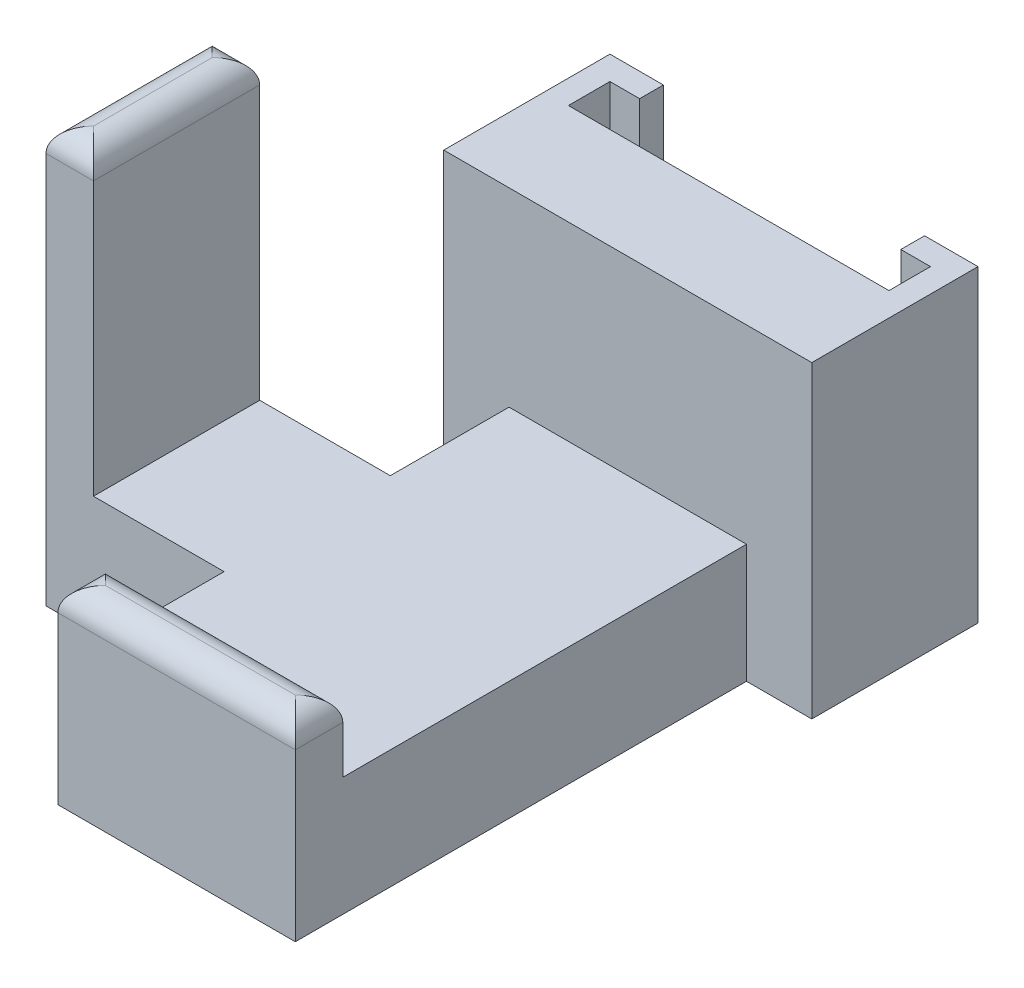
ISO-10303-21;
HEADER;
FILE_DESCRIPTION(('STEP AP214'),'2;1');
FILE_NAME('part.step','',(''),(''),'','','');
FILE_SCHEMA(('AUTOMOTIVE_DESIGN { 1 0 10303 214 1 1 1 1 }'));
ENDSEC;
DATA;
#1=APPLICATION_CONTEXT('core data for automotive mechanical design processes');
#2=APPLICATION_PROTOCOL_DEFINITION('international standard','automotive_design',2000,#1);
#3=PRODUCT_CONTEXT('',#1,'mechanical');
#4=PRODUCT('Part','Part','',(#3));
#5=PRODUCT_RELATED_PRODUCT_CATEGORY('part','',(#4));
#6=PRODUCT_DEFINITION_FORMATION('','',#4);
#7=PRODUCT_DEFINITION_CONTEXT('part definition',#1,'design');
#8=PRODUCT_DEFINITION('design','',#6,#7);
#9=PRODUCT_DEFINITION_SHAPE('','',#8);
#10=(LENGTH_UNIT() NAMED_UNIT(*) SI_UNIT(.MILLI.,.METRE.));
#11=(NAMED_UNIT(*) PLANE_ANGLE_UNIT() SI_UNIT($,.RADIAN.));
#12=(NAMED_UNIT(*) SI_UNIT($,.STERADIAN.) SOLID_ANGLE_UNIT());
#13=UNCERTAINTY_MEASURE_WITH_UNIT(LENGTH_MEASURE(1.E-05),#10,'distance_accuracy_value','');
#14=(GEOMETRIC_REPRESENTATION_CONTEXT(3) GLOBAL_UNCERTAINTY_ASSIGNED_CONTEXT((#13)) GLOBAL_UNIT_ASSIGNED_CONTEXT((#10,
#11,#12)) REPRESENTATION_CONTEXT('',''));
#15=CARTESIAN_POINT('',(0.,0.,0.));
#16=DIRECTION('',(0.,0.,1.));
#17=DIRECTION('',(1.,0.,0.));
#18=AXIS2_PLACEMENT_3D('',#15,#16,#17);
#19=CARTESIAN_POINT('',(0.,10.,0.));
#20=DIRECTION('',(0.,1.,0.));
#21=DIRECTION('',(0.,0.,1.));
#22=AXIS2_PLACEMENT_3D('',#19,#20,#21);
#23=PLANE('',#22);
#24=DIRECTION('',(0.,0.,-1.));
#25=VECTOR('',#24,1.);
#26=CARTESIAN_POINT('',(20.,10.,0.));
#27=LINE('',#26,#25);
#28=CARTESIAN_POINT('',(20.,10.,-3.99999999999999));
#29=VERTEX_POINT('',#28);
#30=CARTESIAN_POINT('',(20.,10.,-38.));
#31=VERTEX_POINT('',#30);
#32=EDGE_CURVE('E386',#29,#31,#27,.T.);
#33=ORIENTED_EDGE('',*,*,#32,.T.);
#34=DIRECTION('',(1.,0.,0.));
#35=VECTOR('',#34,1.);
#36=CARTESIAN_POINT('',(20.,10.,-38.));
#37=LINE('',#36,#35);
#38=CARTESIAN_POINT('',(0.,10.,-38.));
#39=VERTEX_POINT('',#38);
#40=EDGE_CURVE('E267',#39,#31,#37,.T.);
#41=ORIENTED_EDGE('',*,*,#40,.F.);
#42=DIRECTION('',(0.,0.,1.));
#43=VECTOR('',#42,1.);
#44=CARTESIAN_POINT('',(0.,10.,-28.));
#45=LINE('',#44,#43);
#46=CARTESIAN_POINT('',(0.,10.,-28.));
#47=VERTEX_POINT('',#46);
#48=EDGE_CURVE('E391',#39,#47,#45,.T.);
#49=ORIENTED_EDGE('',*,*,#48,.T.);
#50=DIRECTION('',(-1.,0.,0.));
#51=VECTOR('',#50,1.);
#52=CARTESIAN_POINT('',(0.,10.,-28.));
#53=LINE('',#52,#51);
#54=CARTESIAN_POINT('',(-11.,10.,-28.));
#55=VERTEX_POINT('',#54);
#56=EDGE_CURVE('E394',#47,#55,#53,.T.);
#57=ORIENTED_EDGE('',*,*,#56,.T.);
#58=DIRECTION('',(0.,0.,-1.));
#59=VECTOR('',#58,1.);
#60=CARTESIAN_POINT('',(-11.,10.,-28.));
#61=LINE('',#60,#59);
#62=CARTESIAN_POINT('',(-11.,10.,-14.));
#63=VERTEX_POINT('',#62);
#64=EDGE_CURVE('E371',#63,#55,#61,.T.);
#65=ORIENTED_EDGE('',*,*,#64,.F.);
#66=DIRECTION('',(1.,0.,0.));
#67=VECTOR('',#66,1.);
#68=CARTESIAN_POINT('',(0.,10.,-14.));
#69=LINE('',#68,#67);
#70=CARTESIAN_POINT('',(0.,10.,-14.));
#71=VERTEX_POINT('',#70);
#72=EDGE_CURVE('E398',#63,#71,#69,.T.);
#73=ORIENTED_EDGE('',*,*,#72,.T.);
#74=DIRECTION('',(0.,0.,1.));
#75=VECTOR('',#74,1.);
#76=CARTESIAN_POINT('',(0.,10.,0.));
#77=LINE('',#76,#75);
#78=CARTESIAN_POINT('',(0.,10.,-4.));
#79=VERTEX_POINT('',#78);
#80=EDGE_CURVE('E382',#71,#79,#77,.T.);
#81=ORIENTED_EDGE('',*,*,#80,.T.);
#82=DIRECTION('',(-1.,0.,0.));
#83=VECTOR('',#82,1.);
#84=CARTESIAN_POINT('',(0.,10.,-4.));
#85=LINE('',#84,#83);
#86=EDGE_CURVE('E360',#29,#79,#85,.T.);
#87=ORIENTED_EDGE('',*,*,#86,.F.);
#88=EDGE_LOOP('',(#33,#41,#49,#57,#65,#73,#81,#87));
#89=FACE_BOUND('',#88,.T.);
#90=ADVANCED_FACE('F42',(#89),#23,.T.);
#91=CARTESIAN_POINT('',(20.,10.,0.));
#92=DIRECTION('',(-1.,0.,0.));
#93=DIRECTION('',(0.,0.,1.));
#94=AXIS2_PLACEMENT_3D('',#91,#92,#93);
#95=PLANE('',#94);
#96=DIRECTION('',(0.,-1.,0.));
#97=VECTOR('',#96,1.);
#98=CARTESIAN_POINT('',(20.,10.,-38.));
#99=LINE('',#98,#97);
#100=CARTESIAN_POINT('',(20.,0.,-38.));
#101=VERTEX_POINT('',#100);
#102=EDGE_CURVE('E355',#31,#101,#99,.T.);
#103=ORIENTED_EDGE('',*,*,#102,.F.);
#104=ORIENTED_EDGE('',*,*,#32,.F.);
#105=DIRECTION('',(0.,-1.,0.));
#106=VECTOR('',#105,1.);
#107=CARTESIAN_POINT('',(20.,35.,-4.));
#108=LINE('',#107,#106);
#109=CARTESIAN_POINT('',(20.,14.,-4.));
#110=VERTEX_POINT('',#109);
#111=EDGE_CURVE('E368',#110,#29,#108,.T.);
#112=ORIENTED_EDGE('',*,*,#111,.F.);
#113=DIRECTION('',(0.,0.,1.));
#114=VECTOR('',#113,1.);
#115=CARTESIAN_POINT('',(20.,14.,0.));
#116=LINE('',#115,#114);
#117=CARTESIAN_POINT('',(20.,14.,0.));
#118=VERTEX_POINT('',#117);
#119=EDGE_CURVE('E457',#110,#118,#116,.T.);
#120=ORIENTED_EDGE('',*,*,#119,.T.);
#121=DIRECTION('',(0.,-1.,0.));
#122=VECTOR('',#121,1.);
#123=CARTESIAN_POINT('',(20.,10.,0.));
#124=LINE('',#123,#122);
#125=CARTESIAN_POINT('',(20.,0.,0.));
#126=VERTEX_POINT('',#125);
#127=EDGE_CURVE('E438',#118,#126,#124,.T.);
#128=ORIENTED_EDGE('',*,*,#127,.T.);
#129=DIRECTION('',(0.,0.,-1.));
#130=VECTOR('',#129,1.);
#131=CARTESIAN_POINT('',(20.,0.,0.));
#132=LINE('',#131,#130);
#133=EDGE_CURVE('E409',#126,#101,#132,.T.);
#134=ORIENTED_EDGE('',*,*,#133,.T.);
#135=EDGE_LOOP('',(#103,#104,#112,#120,#128,#134));
#136=FACE_BOUND('',#135,.T.);
#137=ADVANCED_FACE('F515',(#136),#95,.F.);
#138=CARTESIAN_POINT('',(0.,10.,-28.));
#139=DIRECTION('',(1.,0.,0.));
#140=DIRECTION('',(0.,0.,-1.));
#141=AXIS2_PLACEMENT_3D('',#138,#139,#140);
#142=PLANE('',#141);
#143=ORIENTED_EDGE('',*,*,#48,.F.);
#144=DIRECTION('',(0.,1.,0.));
#145=VECTOR('',#144,1.);
#146=CARTESIAN_POINT('',(0.,10.,-38.));
#147=LINE('',#146,#145);
#148=CARTESIAN_POINT('',(0.,0.,-38.));
#149=VERTEX_POINT('',#148);
#150=EDGE_CURVE('E349',#149,#39,#147,.T.);
#151=ORIENTED_EDGE('',*,*,#150,.F.);
#152=DIRECTION('',(0.,0.,1.));
#153=VECTOR('',#152,1.);
#154=CARTESIAN_POINT('',(0.,0.,-28.));
#155=LINE('',#154,#153);
#156=CARTESIAN_POINT('',(0.,0.,-28.));
#157=VERTEX_POINT('',#156);
#158=EDGE_CURVE('E412',#149,#157,#155,.T.);
#159=ORIENTED_EDGE('',*,*,#158,.T.);
#160=DIRECTION('',(0.,-1.,0.));
#161=VECTOR('',#160,1.);
#162=CARTESIAN_POINT('',(0.,10.,-28.));
#163=LINE('',#162,#161);
#164=EDGE_CURVE('E434',#47,#157,#163,.T.);
#165=ORIENTED_EDGE('',*,*,#164,.F.);
#166=EDGE_LOOP('',(#143,#151,#159,#165));
#167=FACE_BOUND('',#166,.T.);
#168=ADVANCED_FACE('F565',(#167),#142,.F.);
#169=CARTESIAN_POINT('',(0.,10.,0.));
#170=DIRECTION('',(1.,0.,0.));
#171=DIRECTION('',(0.,0.,-1.));
#172=AXIS2_PLACEMENT_3D('',#169,#170,#171);
#173=PLANE('',#172);
#174=DIRECTION('',(0.,-1.,0.));
#175=VECTOR('',#174,1.);
#176=CARTESIAN_POINT('',(0.,10.,0.));
#177=LINE('',#176,#175);
#178=CARTESIAN_POINT('',(0.,14.,0.));
#179=VERTEX_POINT('',#178);
#180=CARTESIAN_POINT('',(0.,0.,0.));
#181=VERTEX_POINT('',#180);
#182=EDGE_CURVE('E441',#179,#181,#177,.T.);
#183=ORIENTED_EDGE('',*,*,#182,.F.);
#184=DIRECTION('',(0.,0.,-1.));
#185=VECTOR('',#184,1.);
#186=CARTESIAN_POINT('',(0.,14.,-4.));
#187=LINE('',#186,#185);
#188=CARTESIAN_POINT('',(0.,14.,-4.));
#189=VERTEX_POINT('',#188);
#190=EDGE_CURVE('E52',#179,#189,#187,.T.);
#191=ORIENTED_EDGE('',*,*,#190,.T.);
#192=DIRECTION('',(0.,-1.,0.));
#193=VECTOR('',#192,1.);
#194=CARTESIAN_POINT('',(0.,35.,-4.));
#195=LINE('',#194,#193);
#196=EDGE_CURVE('E364',#189,#79,#195,.T.);
#197=ORIENTED_EDGE('',*,*,#196,.T.);
#198=ORIENTED_EDGE('',*,*,#80,.F.);
#199=DIRECTION('',(0.,-1.,0.));
#200=VECTOR('',#199,1.);
#201=CARTESIAN_POINT('',(0.,10.,-14.));
#202=LINE('',#201,#200);
#203=CARTESIAN_POINT('',(0.,0.,-14.));
#204=VERTEX_POINT('',#203);
#205=EDGE_CURVE('E401',#71,#204,#202,.T.);
#206=ORIENTED_EDGE('',*,*,#205,.T.);
#207=DIRECTION('',(0.,0.,1.));
#208=VECTOR('',#207,1.);
#209=CARTESIAN_POINT('',(0.,0.,0.));
#210=LINE('',#209,#208);
#211=EDGE_CURVE('E381',#204,#181,#210,.T.);
#212=ORIENTED_EDGE('',*,*,#211,.T.);
#213=EDGE_LOOP('',(#183,#191,#197,#198,#206,#212));
#214=FACE_BOUND('',#213,.T.);
#215=ADVANCED_FACE('F588',(#214),#173,.F.);
#216=CARTESIAN_POINT('',(0.,10.,0.));
#217=DIRECTION('',(0.,0.,-1.));
#218=DIRECTION('',(-1.,0.,0.));
#219=AXIS2_PLACEMENT_3D('',#216,#217,#218);
#220=PLANE('',#219);
#221=ORIENTED_EDGE('',*,*,#127,.F.);
#222=DIRECTION('',(-1.,0.,0.));
#223=VECTOR('',#222,1.);
#224=CARTESIAN_POINT('',(0.,14.,0.));
#225=LINE('',#224,#223);
#226=EDGE_CURVE('E461',#118,#179,#225,.T.);
#227=ORIENTED_EDGE('',*,*,#226,.T.);
#228=ORIENTED_EDGE('',*,*,#182,.T.);
#229=DIRECTION('',(1.,0.,0.));
#230=VECTOR('',#229,1.);
#231=CARTESIAN_POINT('',(0.,0.,0.));
#232=LINE('',#231,#230);
#233=EDGE_CURVE('E405',#181,#126,#232,.T.);
#234=ORIENTED_EDGE('',*,*,#233,.T.);
#235=EDGE_LOOP('',(#221,#227,#228,#234));
#236=FACE_BOUND('',#235,.T.);
#237=ADVANCED_FACE('F518',(#236),#220,.F.);
#238=CARTESIAN_POINT('',(0.,35.,-4.));
#239=DIRECTION('',(0.,0.,1.));
#240=DIRECTION('',(1.,0.,0.));
#241=AXIS2_PLACEMENT_3D('',#238,#239,#240);
#242=PLANE('',#241);
#243=ORIENTED_EDGE('',*,*,#196,.F.);
#244=DIRECTION('',(-1.,0.,0.));
#245=VECTOR('',#244,1.);
#246=CARTESIAN_POINT('',(20.,14.,-4.));
#247=LINE('',#246,#245);
#248=EDGE_CURVE('E13',#189,#110,#247,.F.);
#249=ORIENTED_EDGE('',*,*,#248,.T.);
#250=ORIENTED_EDGE('',*,*,#111,.T.);
#251=ORIENTED_EDGE('',*,*,#86,.T.);
#252=EDGE_LOOP('',(#243,#249,#250,#251));
#253=FACE_BOUND('',#252,.T.);
#254=ADVANCED_FACE('F585',(#253),#242,.F.);
#255=CARTESIAN_POINT('',(0.,10.,-28.));
#256=DIRECTION('',(0.,0.,1.));
#257=DIRECTION('',(1.,0.,0.));
#258=AXIS2_PLACEMENT_3D('',#255,#256,#257);
#259=PLANE('',#258);
#260=DIRECTION('',(0.,-1.,0.));
#261=VECTOR('',#260,1.);
#262=CARTESIAN_POINT('',(-15.,10.,-28.));
#263=LINE('',#262,#261);
#264=CARTESIAN_POINT('',(-15.,33.,-28.));
#265=VERTEX_POINT('',#264);
#266=CARTESIAN_POINT('',(-15.,0.,-28.));
#267=VERTEX_POINT('',#266);
#268=EDGE_CURVE('E431',#265,#267,#263,.T.);
#269=ORIENTED_EDGE('',*,*,#268,.F.);
#270=DIRECTION('',(-1.,0.,0.));
#271=VECTOR('',#270,1.);
#272=CARTESIAN_POINT('',(-11.,33.,-28.));
#273=LINE('',#272,#271);
#274=CARTESIAN_POINT('',(-11.,33.,-28.));
#275=VERTEX_POINT('',#274);
#276=EDGE_CURVE('E444',#265,#275,#273,.F.);
#277=ORIENTED_EDGE('',*,*,#276,.T.);
#278=DIRECTION('',(0.,-1.,0.));
#279=VECTOR('',#278,1.);
#280=CARTESIAN_POINT('',(-11.,35.,-28.));
#281=LINE('',#280,#279);
#282=EDGE_CURVE('E375',#275,#55,#281,.T.);
#283=ORIENTED_EDGE('',*,*,#282,.T.);
#284=ORIENTED_EDGE('',*,*,#56,.F.);
#285=ORIENTED_EDGE('',*,*,#164,.T.);
#286=DIRECTION('',(-1.,0.,0.));
#287=VECTOR('',#286,1.);
#288=CARTESIAN_POINT('',(0.,0.,-28.));
#289=LINE('',#288,#287);
#290=EDGE_CURVE('E415',#157,#267,#289,.T.);
#291=ORIENTED_EDGE('',*,*,#290,.T.);
#292=EDGE_LOOP('',(#269,#277,#283,#284,#285,#291));
#293=FACE_BOUND('',#292,.T.);
#294=ADVANCED_FACE('F581',(#293),#259,.F.);
#295=CARTESIAN_POINT('',(-15.,10.,-14.));
#296=DIRECTION('',(1.,0.,0.));
#297=DIRECTION('',(0.,0.,-1.));
#298=AXIS2_PLACEMENT_3D('',#295,#296,#297);
#299=PLANE('',#298);
#300=DIRECTION('',(0.,-1.,0.));
#301=VECTOR('',#300,1.);
#302=CARTESIAN_POINT('',(-15.,10.,-14.));
#303=LINE('',#302,#301);
#304=CARTESIAN_POINT('',(-15.,33.,-14.));
#305=VERTEX_POINT('',#304);
#306=CARTESIAN_POINT('',(-15.,0.,-14.));
#307=VERTEX_POINT('',#306);
#308=EDGE_CURVE('E428',#305,#307,#303,.T.);
#309=ORIENTED_EDGE('',*,*,#308,.F.);
#310=DIRECTION('',(0.,0.,1.));
#311=VECTOR('',#310,1.);
#312=CARTESIAN_POINT('',(-15.,33.,-28.));
#313=LINE('',#312,#311);
#314=EDGE_CURVE('E454',#305,#265,#313,.F.);
#315=ORIENTED_EDGE('',*,*,#314,.T.);
#316=ORIENTED_EDGE('',*,*,#268,.T.);
#317=DIRECTION('',(0.,0.,1.));
#318=VECTOR('',#317,1.);
#319=CARTESIAN_POINT('',(-15.,0.,-14.));
#320=LINE('',#319,#318);
#321=EDGE_CURVE('E419',#267,#307,#320,.T.);
#322=ORIENTED_EDGE('',*,*,#321,.T.);
#323=EDGE_LOOP('',(#309,#315,#316,#322));
#324=FACE_BOUND('',#323,.T.);
#325=ADVANCED_FACE('F577',(#324),#299,.F.);
#326=CARTESIAN_POINT('',(0.,10.,-14.));
#327=DIRECTION('',(0.,0.,-1.));
#328=DIRECTION('',(-1.,0.,0.));
#329=AXIS2_PLACEMENT_3D('',#326,#327,#328);
#330=PLANE('',#329);
#331=DIRECTION('',(0.,-1.,0.));
#332=VECTOR('',#331,1.);
#333=CARTESIAN_POINT('',(-11.,35.,-14.));
#334=LINE('',#333,#332);
#335=CARTESIAN_POINT('',(-11.,33.,-14.));
#336=VERTEX_POINT('',#335);
#337=EDGE_CURVE('E378',#336,#63,#334,.T.);
#338=ORIENTED_EDGE('',*,*,#337,.F.);
#339=DIRECTION('',(1.,0.,0.));
#340=VECTOR('',#339,1.);
#341=CARTESIAN_POINT('',(-15.,33.,-14.));
#342=LINE('',#341,#340);
#343=EDGE_CURVE('E451',#336,#305,#342,.F.);
#344=ORIENTED_EDGE('',*,*,#343,.T.);
#345=ORIENTED_EDGE('',*,*,#308,.T.);
#346=DIRECTION('',(1.,0.,0.));
#347=VECTOR('',#346,1.);
#348=CARTESIAN_POINT('',(0.,0.,-14.));
#349=LINE('',#348,#347);
#350=EDGE_CURVE('E387',#307,#204,#349,.T.);
#351=ORIENTED_EDGE('',*,*,#350,.T.);
#352=ORIENTED_EDGE('',*,*,#205,.F.);
#353=ORIENTED_EDGE('',*,*,#72,.F.);
#354=EDGE_LOOP('',(#338,#344,#345,#351,#352,#353));
#355=FACE_BOUND('',#354,.T.);
#356=ADVANCED_FACE('F573',(#355),#330,.F.);
#357=CARTESIAN_POINT('',(0.,0.,0.));
#358=DIRECTION('',(0.,1.,0.));
#359=DIRECTION('',(0.,0.,1.));
#360=AXIS2_PLACEMENT_3D('',#357,#358,#359);
#361=PLANE('',#360);
#362=CARTESIAN_POINT('',(-7.5,0.,-21.));
#363=DIRECTION('',(0.,-1.,0.));
#364=DIRECTION('',(0.,0.,-1.));
#365=AXIS2_PLACEMENT_3D('',#362,#363,#364);
#366=CIRCLE('',#365,1.74999999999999);
#367=CARTESIAN_POINT('',(-7.5,0.,-22.75));
#368=VERTEX_POINT('',#367);
#369=EDGE_CURVE('E304',#368,#368,#366,.T.);
#370=ORIENTED_EDGE('',*,*,#369,.F.);
#371=EDGE_LOOP('',(#370));
#372=FACE_BOUND('',#371,.T.);
#373=CARTESIAN_POINT('',(7.5,0.,-6.));
#374=DIRECTION('',(0.,-1.,0.));
#375=DIRECTION('',(0.,0.,-1.));
#376=AXIS2_PLACEMENT_3D('',#373,#374,#375);
#377=CIRCLE('',#376,1.74999999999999);
#378=CARTESIAN_POINT('',(7.5,0.,-7.74999999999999));
#379=VERTEX_POINT('',#378);
#380=EDGE_CURVE('E312',#379,#379,#377,.T.);
#381=ORIENTED_EDGE('',*,*,#380,.F.);
#382=EDGE_LOOP('',(#381));
#383=FACE_BOUND('',#382,.T.);
#384=DIRECTION('',(-1.,0.,0.));
#385=VECTOR('',#384,1.);
#386=CARTESIAN_POINT('',(25.5,0.,-38.));
#387=LINE('',#386,#385);
#388=CARTESIAN_POINT('',(25.5,0.,-38.));
#389=VERTEX_POINT('',#388);
#390=EDGE_CURVE('E341',#389,#101,#387,.T.);
#391=ORIENTED_EDGE('',*,*,#390,.T.);
#392=ORIENTED_EDGE('',*,*,#133,.F.);
#393=ORIENTED_EDGE('',*,*,#233,.F.);
#394=ORIENTED_EDGE('',*,*,#211,.F.);
#395=ORIENTED_EDGE('',*,*,#350,.F.);
#396=ORIENTED_EDGE('',*,*,#321,.F.);
#397=ORIENTED_EDGE('',*,*,#290,.F.);
#398=ORIENTED_EDGE('',*,*,#158,.F.);
#399=CARTESIAN_POINT('',(-5.5,0.,-38.));
#400=VERTEX_POINT('',#399);
#401=EDGE_CURVE('E340',#149,#400,#387,.T.);
#402=ORIENTED_EDGE('',*,*,#401,.T.);
#403=DIRECTION('',(0.,0.,-1.));
#404=VECTOR('',#403,1.);
#405=CARTESIAN_POINT('',(-5.5,0.,-38.));
#406=LINE('',#405,#404);
#407=CARTESIAN_POINT('',(-5.5,0.,-52.));
#408=VERTEX_POINT('',#407);
#409=EDGE_CURVE('E346',#400,#408,#406,.T.);
#410=ORIENTED_EDGE('',*,*,#409,.T.);
#411=DIRECTION('',(-1.,0.,0.));
#412=VECTOR('',#411,1.);
#413=CARTESIAN_POINT('',(25.5,0.,-52.));
#414=LINE('',#413,#412);
#415=CARTESIAN_POINT('',(25.5,0.,-52.));
#416=VERTEX_POINT('',#415);
#417=EDGE_CURVE('E328',#416,#408,#414,.T.);
#418=ORIENTED_EDGE('',*,*,#417,.F.);
#419=DIRECTION('',(0.,0.,-1.));
#420=VECTOR('',#419,1.);
#421=CARTESIAN_POINT('',(25.5,0.,-38.));
#422=LINE('',#421,#420);
#423=EDGE_CURVE('E345',#389,#416,#422,.T.);
#424=ORIENTED_EDGE('',*,*,#423,.F.);
#425=EDGE_LOOP('',(#391,#392,#393,#394,#395,#396,#397,#398,#402,#410,#418,#424));
#426=FACE_BOUND('',#425,.T.);
#427=ADVANCED_FACE('F524',(#372,#383,#426),#361,.F.);
#428=CARTESIAN_POINT('',(-11.,35.,-28.));
#429=DIRECTION('',(-1.,0.,0.));
#430=DIRECTION('',(0.,0.,1.));
#431=AXIS2_PLACEMENT_3D('',#428,#429,#430);
#432=PLANE('',#431);
#433=ORIENTED_EDGE('',*,*,#282,.F.);
#434=DIRECTION('',(0.,0.,-1.));
#435=VECTOR('',#434,1.);
#436=CARTESIAN_POINT('',(-11.,33.,-14.));
#437=LINE('',#436,#435);
#438=EDGE_CURVE('E448',#275,#336,#437,.F.);
#439=ORIENTED_EDGE('',*,*,#438,.T.);
#440=ORIENTED_EDGE('',*,*,#337,.T.);
#441=ORIENTED_EDGE('',*,*,#64,.T.);
#442=EDGE_LOOP('',(#433,#439,#440,#441));
#443=FACE_BOUND('',#442,.T.);
#444=ADVANCED_FACE('F569',(#443),#432,.F.);
#445=CARTESIAN_POINT('',(0.,33.,-16.));
#446=DIRECTION('',(-1.,0.,0.));
#447=DIRECTION('',(0.,0.,1.));
#448=AXIS2_PLACEMENT_3D('',#445,#446,#447);
#449=CYLINDRICAL_SURFACE('',#448,2.);
#450=CARTESIAN_POINT('',(-13.,33.,-16.));
#451=DIRECTION('',(-0.707106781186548,0.,-0.707106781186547));
#452=DIRECTION('',(0.707106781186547,0.,-0.707106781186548));
#453=AXIS2_PLACEMENT_3D('',#450,#451,#452);
#454=ELLIPSE('',#453,2.82842712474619,2.);
#455=CARTESIAN_POINT('',(-13.,35.,-16.));
#456=VERTEX_POINT('',#455);
#457=EDGE_CURVE('E473',#305,#456,#454,.T.);
#458=ORIENTED_EDGE('',*,*,#457,.F.);
#459=ORIENTED_EDGE('',*,*,#343,.F.);
#460=CARTESIAN_POINT('',(-13.,33.,-16.));
#461=DIRECTION('',(-0.707106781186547,0.,0.707106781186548));
#462=DIRECTION('',(-0.707106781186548,0.,-0.707106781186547));
#463=AXIS2_PLACEMENT_3D('',#460,#461,#462);
#464=ELLIPSE('',#463,2.82842712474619,2.);
#465=EDGE_CURVE('E365',#456,#336,#464,.F.);
#466=ORIENTED_EDGE('',*,*,#465,.F.);
#467=EDGE_LOOP('',(#458,#459,#466));
#468=FACE_BOUND('',#467,.T.);
#469=ADVANCED_FACE('F607',(#468),#449,.T.);
#470=CARTESIAN_POINT('',(-13.,33.,0.));
#471=DIRECTION('',(0.,0.,1.));
#472=DIRECTION('',(1.,0.,0.));
#473=AXIS2_PLACEMENT_3D('',#470,#471,#472);
#474=CYLINDRICAL_SURFACE('',#473,2.);
#475=DIRECTION('',(0.,0.,-1.));
#476=VECTOR('',#475,1.);
#477=CARTESIAN_POINT('',(-13.,35.,-28.));
#478=LINE('',#477,#476);
#479=CARTESIAN_POINT('',(-13.,35.,-26.));
#480=VERTEX_POINT('',#479);
#481=EDGE_CURVE('E477',#456,#480,#478,.T.);
#482=ORIENTED_EDGE('',*,*,#481,.F.);
#483=ORIENTED_EDGE('',*,*,#465,.T.);
#484=ORIENTED_EDGE('',*,*,#438,.F.);
#485=CARTESIAN_POINT('',(-13.,33.,-26.));
#486=DIRECTION('',(0.707106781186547,0.,0.707106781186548));
#487=DIRECTION('',(-0.707106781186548,0.,0.707106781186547));
#488=AXIS2_PLACEMENT_3D('',#485,#486,#487);
#489=ELLIPSE('',#488,2.82842712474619,2.);
#490=EDGE_CURVE('E470',#480,#275,#489,.F.);
#491=ORIENTED_EDGE('',*,*,#490,.F.);
#492=EDGE_LOOP('',(#482,#483,#484,#491));
#493=FACE_BOUND('',#492,.T.);
#494=ADVANCED_FACE('F603',(#493),#474,.T.);
#495=CARTESIAN_POINT('',(-13.,33.,0.));
#496=DIRECTION('',(0.,0.,-1.));
#497=DIRECTION('',(-1.,0.,0.));
#498=AXIS2_PLACEMENT_3D('',#495,#496,#497);
#499=CYLINDRICAL_SURFACE('',#498,2.);
#500=ORIENTED_EDGE('',*,*,#457,.T.);
#501=ORIENTED_EDGE('',*,*,#481,.T.);
#502=CARTESIAN_POINT('',(-13.,33.,-26.));
#503=DIRECTION('',(0.707106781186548,0.,-0.707106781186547));
#504=DIRECTION('',(-0.707106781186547,0.,-0.707106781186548));
#505=AXIS2_PLACEMENT_3D('',#502,#503,#504);
#506=ELLIPSE('',#505,2.82842712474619,2.);
#507=EDGE_CURVE('E466',#265,#480,#506,.T.);
#508=ORIENTED_EDGE('',*,*,#507,.F.);
#509=ORIENTED_EDGE('',*,*,#314,.F.);
#510=EDGE_LOOP('',(#500,#501,#508,#509));
#511=FACE_BOUND('',#510,.T.);
#512=ADVANCED_FACE('F599',(#511),#499,.T.);
#513=CARTESIAN_POINT('',(0.,33.,-26.));
#514=DIRECTION('',(1.,0.,0.));
#515=DIRECTION('',(0.,0.,-1.));
#516=AXIS2_PLACEMENT_3D('',#513,#514,#515);
#517=CYLINDRICAL_SURFACE('',#516,2.);
#518=ORIENTED_EDGE('',*,*,#490,.T.);
#519=ORIENTED_EDGE('',*,*,#276,.F.);
#520=ORIENTED_EDGE('',*,*,#507,.T.);
#521=EDGE_LOOP('',(#518,#519,#520));
#522=FACE_BOUND('',#521,.T.);
#523=ADVANCED_FACE('F596',(#522),#517,.T.);
#524=CARTESIAN_POINT('',(2.,14.,0.));
#525=DIRECTION('',(0.,0.,1.));
#526=DIRECTION('',(1.,0.,0.));
#527=AXIS2_PLACEMENT_3D('',#524,#525,#526);
#528=CYLINDRICAL_SURFACE('',#527,2.);
#529=CARTESIAN_POINT('',(2.,14.,-2.));
#530=DIRECTION('',(0.707106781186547,0.,-0.707106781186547));
#531=DIRECTION('',(0.707106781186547,0.,0.707106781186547));
#532=AXIS2_PLACEMENT_3D('',#529,#530,#531);
#533=ELLIPSE('',#532,2.82842712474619,2.);
#534=CARTESIAN_POINT('',(2.,16.,-2.));
#535=VERTEX_POINT('',#534);
#536=EDGE_CURVE('E46',#189,#535,#533,.T.);
#537=ORIENTED_EDGE('',*,*,#536,.F.);
#538=ORIENTED_EDGE('',*,*,#190,.F.);
#539=CARTESIAN_POINT('',(2.,14.,-2.));
#540=DIRECTION('',(0.707106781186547,0.,0.707106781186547));
#541=DIRECTION('',(-0.707106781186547,0.,0.707106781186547));
#542=AXIS2_PLACEMENT_3D('',#539,#540,#541);
#543=ELLIPSE('',#542,2.82842712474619,2.);
#544=EDGE_CURVE('E492',#535,#179,#543,.T.);
#545=ORIENTED_EDGE('',*,*,#544,.F.);
#546=EDGE_LOOP('',(#537,#538,#545));
#547=FACE_BOUND('',#546,.T.);
#548=ADVANCED_FACE('F44',(#547),#528,.T.);
#549=CARTESIAN_POINT('',(0.,14.,-2.));
#550=DIRECTION('',(1.,0.,0.));
#551=DIRECTION('',(0.,0.,-1.));
#552=AXIS2_PLACEMENT_3D('',#549,#550,#551);
#553=CYLINDRICAL_SURFACE('',#552,2.);
#554=ORIENTED_EDGE('',*,*,#248,.F.);
#555=ORIENTED_EDGE('',*,*,#536,.T.);
#556=DIRECTION('',(-1.,0.,0.));
#557=VECTOR('',#556,1.);
#558=CARTESIAN_POINT('',(0.,16.,-2.));
#559=LINE('',#558,#557);
#560=CARTESIAN_POINT('',(18.,16.,-2.));
#561=VERTEX_POINT('',#560);
#562=EDGE_CURVE('E489',#561,#535,#559,.T.);
#563=ORIENTED_EDGE('',*,*,#562,.F.);
#564=CARTESIAN_POINT('',(18.,14.,-2.));
#565=DIRECTION('',(0.707106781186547,0.,0.707106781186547));
#566=DIRECTION('',(0.707106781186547,0.,-0.707106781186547));
#567=AXIS2_PLACEMENT_3D('',#564,#565,#566);
#568=ELLIPSE('',#567,2.82842712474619,2.);
#569=EDGE_CURVE('E485',#110,#561,#568,.T.);
#570=ORIENTED_EDGE('',*,*,#569,.F.);
#571=EDGE_LOOP('',(#554,#555,#563,#570));
#572=FACE_BOUND('',#571,.T.);
#573=ADVANCED_FACE('F502',(#572),#553,.T.);
#574=CARTESIAN_POINT('',(0.,14.,-2.));
#575=DIRECTION('',(1.,0.,0.));
#576=DIRECTION('',(0.,0.,-1.));
#577=AXIS2_PLACEMENT_3D('',#574,#575,#576);
#578=CYLINDRICAL_SURFACE('',#577,2.);
#579=ORIENTED_EDGE('',*,*,#544,.T.);
#580=ORIENTED_EDGE('',*,*,#226,.F.);
#581=CARTESIAN_POINT('',(18.,14.,-2.));
#582=DIRECTION('',(0.707106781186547,0.,-0.707106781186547));
#583=DIRECTION('',(0.707106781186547,0.,0.707106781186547));
#584=AXIS2_PLACEMENT_3D('',#581,#582,#583);
#585=ELLIPSE('',#584,2.82842712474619,2.);
#586=EDGE_CURVE('E359',#561,#118,#585,.T.);
#587=ORIENTED_EDGE('',*,*,#586,.F.);
#588=ORIENTED_EDGE('',*,*,#562,.T.);
#589=EDGE_LOOP('',(#579,#580,#587,#588));
#590=FACE_BOUND('',#589,.T.);
#591=ADVANCED_FACE('F507',(#590),#578,.T.);
#592=CARTESIAN_POINT('',(18.,14.,0.));
#593=DIRECTION('',(0.,0.,-1.));
#594=DIRECTION('',(-1.,0.,0.));
#595=AXIS2_PLACEMENT_3D('',#592,#593,#594);
#596=CYLINDRICAL_SURFACE('',#595,2.);
#597=ORIENTED_EDGE('',*,*,#119,.F.);
#598=ORIENTED_EDGE('',*,*,#569,.T.);
#599=ORIENTED_EDGE('',*,*,#586,.T.);
#600=EDGE_LOOP('',(#597,#598,#599));
#601=FACE_BOUND('',#600,.T.);
#602=ADVANCED_FACE('F510',(#601),#596,.T.);
#603=CARTESIAN_POINT('',(0.,0.,-38.));
#604=DIRECTION('',(0.,0.,-1.));
#605=DIRECTION('',(-1.,0.,0.));
#606=AXIS2_PLACEMENT_3D('',#603,#604,#605);
#607=PLANE('',#606);
#608=DIRECTION('',(0.,-1.,0.));
#609=VECTOR('',#608,1.);
#610=CARTESIAN_POINT('',(25.5,0.,-38.));
#611=LINE('',#610,#609);
#612=CARTESIAN_POINT('',(25.5,26.,-38.));
#613=VERTEX_POINT('',#612);
#614=EDGE_CURVE('E336',#613,#389,#611,.T.);
#615=ORIENTED_EDGE('',*,*,#614,.F.);
#616=DIRECTION('',(1.,0.,0.));
#617=VECTOR('',#616,1.);
#618=CARTESIAN_POINT('',(20.,26.,-38.));
#619=LINE('',#618,#617);
#620=CARTESIAN_POINT('',(-5.49999999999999,26.,-38.));
#621=VERTEX_POINT('',#620);
#622=EDGE_CURVE('E290',#621,#613,#619,.T.);
#623=ORIENTED_EDGE('',*,*,#622,.F.);
#624=DIRECTION('',(0.,1.,0.));
#625=VECTOR('',#624,1.);
#626=CARTESIAN_POINT('',(-5.5,4.00000000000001,-38.));
#627=LINE('',#626,#625);
#628=EDGE_CURVE('E332',#400,#621,#627,.T.);
#629=ORIENTED_EDGE('',*,*,#628,.F.);
#630=ORIENTED_EDGE('',*,*,#401,.F.);
#631=ORIENTED_EDGE('',*,*,#150,.T.);
#632=ORIENTED_EDGE('',*,*,#40,.T.);
#633=ORIENTED_EDGE('',*,*,#102,.T.);
#634=ORIENTED_EDGE('',*,*,#390,.F.);
#635=EDGE_LOOP('',(#615,#623,#629,#630,#631,#632,#633,#634));
#636=FACE_BOUND('',#635,.T.);
#637=ADVANCED_FACE('F527',(#636),#607,.F.);
#638=CARTESIAN_POINT('',(-5.5,4.00000000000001,-38.));
#639=DIRECTION('',(-1.,0.,0.));
#640=DIRECTION('',(0.,-1.,0.));
#641=AXIS2_PLACEMENT_3D('',#638,#639,#640);
#642=PLANE('',#641);
#643=ORIENTED_EDGE('',*,*,#628,.T.);
#644=DIRECTION('',(0.,0.,1.));
#645=VECTOR('',#644,1.);
#646=CARTESIAN_POINT('',(-5.49999999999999,26.,-52.));
#647=LINE('',#646,#645);
#648=CARTESIAN_POINT('',(-5.49999999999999,26.,-52.));
#649=VERTEX_POINT('',#648);
#650=EDGE_CURVE('E300',#649,#621,#647,.T.);
#651=ORIENTED_EDGE('',*,*,#650,.F.);
#652=DIRECTION('',(0.,1.,0.));
#653=VECTOR('',#652,1.);
#654=CARTESIAN_POINT('',(-5.5,4.00000000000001,-52.));
#655=LINE('',#654,#653);
#656=EDGE_CURVE('E320',#408,#649,#655,.T.);
#657=ORIENTED_EDGE('',*,*,#656,.F.);
#658=ORIENTED_EDGE('',*,*,#409,.F.);
#659=EDGE_LOOP('',(#643,#651,#657,#658));
#660=FACE_BOUND('',#659,.T.);
#661=ADVANCED_FACE('F734',(#660),#642,.T.);
#662=CARTESIAN_POINT('',(25.5,0.,-38.));
#663=DIRECTION('',(1.,0.,0.));
#664=DIRECTION('',(0.,0.,-1.));
#665=AXIS2_PLACEMENT_3D('',#662,#663,#664);
#666=PLANE('',#665);
#667=ORIENTED_EDGE('',*,*,#423,.T.);
#668=DIRECTION('',(0.,-1.,0.));
#669=VECTOR('',#668,1.);
#670=CARTESIAN_POINT('',(25.5,0.,-52.));
#671=LINE('',#670,#669);
#672=CARTESIAN_POINT('',(25.5,26.,-52.));
#673=VERTEX_POINT('',#672);
#674=EDGE_CURVE('E324',#673,#416,#671,.T.);
#675=ORIENTED_EDGE('',*,*,#674,.F.);
#676=DIRECTION('',(0.,0.,-1.));
#677=VECTOR('',#676,1.);
#678=CARTESIAN_POINT('',(25.5,26.,-38.));
#679=LINE('',#678,#677);
#680=EDGE_CURVE('E294',#613,#673,#679,.T.);
#681=ORIENTED_EDGE('',*,*,#680,.F.);
#682=ORIENTED_EDGE('',*,*,#614,.T.);
#683=EDGE_LOOP('',(#667,#675,#681,#682));
#684=FACE_BOUND('',#683,.T.);
#685=ADVANCED_FACE('F728',(#684),#666,.T.);
#686=CARTESIAN_POINT('',(0.,0.,-52.));
#687=DIRECTION('',(0.,0.,-1.));
#688=DIRECTION('',(-1.,0.,0.));
#689=AXIS2_PLACEMENT_3D('',#686,#687,#688);
#690=PLANE('',#689);
#691=DIRECTION('',(0.,-1.,0.));
#692=VECTOR('',#691,1.);
#693=CARTESIAN_POINT('',(21.,26.,-52.));
#694=LINE('',#693,#692);
#695=CARTESIAN_POINT('',(21.,26.,-52.));
#696=VERTEX_POINT('',#695);
#697=CARTESIAN_POINT('',(21.,14.,-52.));
#698=VERTEX_POINT('',#697);
#699=EDGE_CURVE('E849',#696,#698,#694,.T.);
#700=ORIENTED_EDGE('',*,*,#699,.F.);
#701=DIRECTION('',(-1.,0.,0.));
#702=VECTOR('',#701,1.);
#703=CARTESIAN_POINT('',(25.5,26.,-52.));
#704=LINE('',#703,#702);
#705=EDGE_CURVE('E243',#673,#696,#704,.T.);
#706=ORIENTED_EDGE('',*,*,#705,.F.);
#707=ORIENTED_EDGE('',*,*,#674,.T.);
#708=ORIENTED_EDGE('',*,*,#417,.T.);
#709=ORIENTED_EDGE('',*,*,#656,.T.);
#710=CARTESIAN_POINT('',(-1.,26.,-52.));
#711=VERTEX_POINT('',#710);
#712=EDGE_CURVE('E297',#711,#649,#704,.T.);
#713=ORIENTED_EDGE('',*,*,#712,.F.);
#714=DIRECTION('',(0.,1.,0.));
#715=VECTOR('',#714,1.);
#716=CARTESIAN_POINT('',(-1.,14.,-52.));
#717=LINE('',#716,#715);
#718=CARTESIAN_POINT('',(-1.,14.,-52.));
#719=VERTEX_POINT('',#718);
#720=EDGE_CURVE('E843',#719,#711,#717,.T.);
#721=ORIENTED_EDGE('',*,*,#720,.F.);
#722=DIRECTION('',(-1.,0.,0.));
#723=VECTOR('',#722,1.);
#724=CARTESIAN_POINT('',(21.,14.,-52.));
#725=LINE('',#724,#723);
#726=EDGE_CURVE('E245',#698,#719,#725,.T.);
#727=ORIENTED_EDGE('',*,*,#726,.F.);
#728=EDGE_LOOP('',(#700,#706,#707,#708,#709,#713,#721,#727));
#729=FACE_BOUND('',#728,.T.);
#730=ADVANCED_FACE('F733',(#729),#690,.T.);
#731=CARTESIAN_POINT('',(7.5,4.,-6.));
#732=DIRECTION('',(0.,-1.,0.));
#733=DIRECTION('',(0.,0.,-1.));
#734=AXIS2_PLACEMENT_3D('',#731,#732,#733);
#735=CONICAL_SURFACE('',#734,1.74999999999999,1.02974425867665);
#736=CARTESIAN_POINT('',(7.5,5.05150608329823,-6.));
#737=VERTEX_POINT('',#736);
#738=VERTEX_LOOP('',#737);
#739=FACE_BOUND('',#738,.T.);
#740=CARTESIAN_POINT('',(7.5,4.,-6.));
#741=DIRECTION('',(0.,-1.,0.));
#742=DIRECTION('',(0.,0.,-1.));
#743=AXIS2_PLACEMENT_3D('',#740,#741,#742);
#744=CIRCLE('',#743,1.74999999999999);
#745=CARTESIAN_POINT('',(7.5,4.,-7.74999999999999));
#746=VERTEX_POINT('',#745);
#747=EDGE_CURVE('E316',#746,#746,#744,.T.);
#748=ORIENTED_EDGE('',*,*,#747,.T.);
#749=EDGE_LOOP('',(#748));
#750=FACE_BOUND('',#749,.T.);
#751=ADVANCED_FACE('F777',(#739,#750),#735,.F.);
#752=CARTESIAN_POINT('',(7.5,0.,-6.));
#753=DIRECTION('',(0.,-1.,0.));
#754=DIRECTION('',(0.,0.,-1.));
#755=AXIS2_PLACEMENT_3D('',#752,#753,#754);
#756=CYLINDRICAL_SURFACE('',#755,1.74999999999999);
#757=ORIENTED_EDGE('',*,*,#747,.F.);
#758=EDGE_LOOP('',(#757));
#759=FACE_BOUND('',#758,.T.);
#760=ORIENTED_EDGE('',*,*,#380,.T.);
#761=EDGE_LOOP('',(#760));
#762=FACE_BOUND('',#761,.T.);
#763=ADVANCED_FACE('F768',(#759,#762),#756,.F.);
#764=CARTESIAN_POINT('',(-7.5,4.,-21.));
#765=DIRECTION('',(0.,-1.,0.));
#766=DIRECTION('',(0.,0.,-1.));
#767=AXIS2_PLACEMENT_3D('',#764,#765,#766);
#768=CONICAL_SURFACE('',#767,1.74999999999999,1.02974425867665);
#769=CARTESIAN_POINT('',(-7.5,5.05150608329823,-21.));
#770=VERTEX_POINT('',#769);
#771=VERTEX_LOOP('',#770);
#772=FACE_BOUND('',#771,.T.);
#773=CARTESIAN_POINT('',(-7.5,4.,-21.));
#774=DIRECTION('',(0.,-1.,0.));
#775=DIRECTION('',(0.,0.,-1.));
#776=AXIS2_PLACEMENT_3D('',#773,#774,#775);
#777=CIRCLE('',#776,1.74999999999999);
#778=CARTESIAN_POINT('',(-7.5,4.,-22.75));
#779=VERTEX_POINT('',#778);
#780=EDGE_CURVE('E308',#779,#779,#777,.T.);
#781=ORIENTED_EDGE('',*,*,#780,.T.);
#782=EDGE_LOOP('',(#781));
#783=FACE_BOUND('',#782,.T.);
#784=ADVANCED_FACE('F758',(#772,#783),#768,.F.);
#785=CARTESIAN_POINT('',(-7.5,0.,-21.));
#786=DIRECTION('',(0.,-1.,0.));
#787=DIRECTION('',(0.,0.,-1.));
#788=AXIS2_PLACEMENT_3D('',#785,#786,#787);
#789=CYLINDRICAL_SURFACE('',#788,1.74999999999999);
#790=ORIENTED_EDGE('',*,*,#780,.F.);
#791=EDGE_LOOP('',(#790));
#792=FACE_BOUND('',#791,.T.);
#793=ORIENTED_EDGE('',*,*,#369,.T.);
#794=EDGE_LOOP('',(#793));
#795=FACE_BOUND('',#794,.T.);
#796=ADVANCED_FACE('F558',(#792,#795),#789,.F.);
#797=CARTESIAN_POINT('',(0.,26.,0.));
#798=DIRECTION('',(0.,-1.,0.));
#799=DIRECTION('',(1.,0.,0.));
#800=AXIS2_PLACEMENT_3D('',#797,#798,#799);
#801=PLANE('',#800);
#802=ORIENTED_EDGE('',*,*,#705,.T.);
#803=DIRECTION('',(0.,0.,-1.));
#804=VECTOR('',#803,1.);
#805=CARTESIAN_POINT('',(21.,26.,-24.9400718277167));
#806=LINE('',#805,#804);
#807=CARTESIAN_POINT('',(21.,26.,-50.));
#808=VERTEX_POINT('',#807);
#809=EDGE_CURVE('E227',#808,#696,#806,.T.);
#810=ORIENTED_EDGE('',*,*,#809,.F.);
#811=DIRECTION('',(-1.,0.,0.));
#812=VECTOR('',#811,1.);
#813=CARTESIAN_POINT('',(-3.49999999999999,26.,-50.));
#814=LINE('',#813,#812);
#815=CARTESIAN_POINT('',(23.5,26.,-50.));
#816=VERTEX_POINT('',#815);
#817=EDGE_CURVE('E240',#816,#808,#814,.T.);
#818=ORIENTED_EDGE('',*,*,#817,.F.);
#819=DIRECTION('',(0.,0.,-1.));
#820=VECTOR('',#819,1.);
#821=CARTESIAN_POINT('',(23.5,26.,-50.));
#822=LINE('',#821,#820);
#823=CARTESIAN_POINT('',(23.5,26.,-46.5));
#824=VERTEX_POINT('',#823);
#825=EDGE_CURVE('E260',#824,#816,#822,.T.);
#826=ORIENTED_EDGE('',*,*,#825,.F.);
#827=DIRECTION('',(1.,0.,0.));
#828=VECTOR('',#827,1.);
#829=CARTESIAN_POINT('',(-3.49999999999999,26.,-46.5));
#830=LINE('',#829,#828);
#831=CARTESIAN_POINT('',(-3.49999999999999,26.,-46.5));
#832=VERTEX_POINT('',#831);
#833=EDGE_CURVE('E276',#832,#824,#830,.T.);
#834=ORIENTED_EDGE('',*,*,#833,.F.);
#835=DIRECTION('',(0.,0.,1.));
#836=VECTOR('',#835,1.);
#837=CARTESIAN_POINT('',(-3.49999999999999,26.,-46.5));
#838=LINE('',#837,#836);
#839=CARTESIAN_POINT('',(-3.49999999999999,26.,-50.));
#840=VERTEX_POINT('',#839);
#841=EDGE_CURVE('E253',#840,#832,#838,.T.);
#842=ORIENTED_EDGE('',*,*,#841,.F.);
#843=CARTESIAN_POINT('',(-1.,26.,-50.));
#844=VERTEX_POINT('',#843);
#845=EDGE_CURVE('E254',#844,#840,#814,.T.);
#846=ORIENTED_EDGE('',*,*,#845,.F.);
#847=DIRECTION('',(0.,0.,-1.));
#848=VECTOR('',#847,1.);
#849=CARTESIAN_POINT('',(-1.,26.,-24.9400718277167));
#850=LINE('',#849,#848);
#851=EDGE_CURVE('E60',#844,#711,#850,.T.);
#852=ORIENTED_EDGE('',*,*,#851,.T.);
#853=ORIENTED_EDGE('',*,*,#712,.T.);
#854=ORIENTED_EDGE('',*,*,#650,.T.);
#855=ORIENTED_EDGE('',*,*,#622,.T.);
#856=ORIENTED_EDGE('',*,*,#680,.T.);
#857=EDGE_LOOP('',(#802,#810,#818,#826,#834,#842,#846,#852,#853,#854,#855,#856));
#858=FACE_BOUND('',#857,.T.);
#859=ADVANCED_FACE('F238',(#858),#801,.F.);
#860=CARTESIAN_POINT('',(-3.49999999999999,26.,-46.5));
#861=DIRECTION('',(0.,0.,-1.));
#862=DIRECTION('',(-1.,0.,0.));
#863=AXIS2_PLACEMENT_3D('',#860,#861,#862);
#864=PLANE('',#863);
#865=DIRECTION('',(1.,0.,0.));
#866=VECTOR('',#865,1.);
#867=CARTESIAN_POINT('',(-3.5,4.00000000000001,-46.5));
#868=LINE('',#867,#866);
#869=CARTESIAN_POINT('',(-3.5,4.00000000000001,-46.5));
#870=VERTEX_POINT('',#869);
#871=CARTESIAN_POINT('',(23.5,4.,-46.5));
#872=VERTEX_POINT('',#871);
#873=EDGE_CURVE('E68',#870,#872,#868,.T.);
#874=ORIENTED_EDGE('',*,*,#873,.F.);
#875=DIRECTION('',(0.,-1.,0.));
#876=VECTOR('',#875,1.);
#877=CARTESIAN_POINT('',(-3.49999999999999,26.,-46.5));
#878=LINE('',#877,#876);
#879=EDGE_CURVE('E258',#832,#870,#878,.T.);
#880=ORIENTED_EDGE('',*,*,#879,.F.);
#881=ORIENTED_EDGE('',*,*,#833,.T.);
#882=DIRECTION('',(0.,-1.,0.));
#883=VECTOR('',#882,1.);
#884=CARTESIAN_POINT('',(23.5,26.,-46.5));
#885=LINE('',#884,#883);
#886=EDGE_CURVE('E286',#824,#872,#885,.T.);
#887=ORIENTED_EDGE('',*,*,#886,.T.);
#888=EDGE_LOOP('',(#874,#880,#881,#887));
#889=FACE_BOUND('',#888,.T.);
#890=ADVANCED_FACE('F550',(#889),#864,.T.);
#891=CARTESIAN_POINT('',(23.5,26.,-50.));
#892=DIRECTION('',(-1.,0.,0.));
#893=DIRECTION('',(0.,-1.,0.));
#894=AXIS2_PLACEMENT_3D('',#891,#892,#893);
#895=PLANE('',#894);
#896=DIRECTION('',(0.,0.,-1.));
#897=VECTOR('',#896,1.);
#898=CARTESIAN_POINT('',(23.5,4.,-50.));
#899=LINE('',#898,#897);
#900=CARTESIAN_POINT('',(23.5,4.,-50.));
#901=VERTEX_POINT('',#900);
#902=EDGE_CURVE('E266',#872,#901,#899,.T.);
#903=ORIENTED_EDGE('',*,*,#902,.F.);
#904=ORIENTED_EDGE('',*,*,#886,.F.);
#905=ORIENTED_EDGE('',*,*,#825,.T.);
#906=DIRECTION('',(0.,-1.,0.));
#907=VECTOR('',#906,1.);
#908=CARTESIAN_POINT('',(23.5,26.,-50.));
#909=LINE('',#908,#907);
#910=EDGE_CURVE('E251',#816,#901,#909,.T.);
#911=ORIENTED_EDGE('',*,*,#910,.T.);
#912=EDGE_LOOP('',(#903,#904,#905,#911));
#913=FACE_BOUND('',#912,.T.);
#914=ADVANCED_FACE('F543',(#913),#895,.T.);
#915=CARTESIAN_POINT('',(-3.49999999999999,26.,-50.));
#916=DIRECTION('',(0.,0.,1.));
#917=DIRECTION('',(1.,0.,0.));
#918=AXIS2_PLACEMENT_3D('',#915,#916,#917);
#919=PLANE('',#918);
#920=DIRECTION('',(0.,-1.,0.));
#921=VECTOR('',#920,1.);
#922=CARTESIAN_POINT('',(21.,26.,-50.));
#923=LINE('',#922,#921);
#924=CARTESIAN_POINT('',(21.,14.,-50.));
#925=VERTEX_POINT('',#924);
#926=EDGE_CURVE('E223',#808,#925,#923,.T.);
#927=ORIENTED_EDGE('',*,*,#926,.T.);
#928=DIRECTION('',(-1.,0.,0.));
#929=VECTOR('',#928,1.);
#930=CARTESIAN_POINT('',(21.,14.,-50.));
#931=LINE('',#930,#929);
#932=CARTESIAN_POINT('',(-1.,14.,-50.));
#933=VERTEX_POINT('',#932);
#934=EDGE_CURVE('E845',#925,#933,#931,.T.);
#935=ORIENTED_EDGE('',*,*,#934,.T.);
#936=DIRECTION('',(0.,1.,0.));
#937=VECTOR('',#936,1.);
#938=CARTESIAN_POINT('',(-1.,14.,-50.));
#939=LINE('',#938,#937);
#940=EDGE_CURVE('E534',#933,#844,#939,.T.);
#941=ORIENTED_EDGE('',*,*,#940,.T.);
#942=ORIENTED_EDGE('',*,*,#845,.T.);
#943=DIRECTION('',(0.,-1.,0.));
#944=VECTOR('',#943,1.);
#945=CARTESIAN_POINT('',(-3.49999999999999,26.,-50.));
#946=LINE('',#945,#944);
#947=CARTESIAN_POINT('',(-3.5,4.00000000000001,-50.));
#948=VERTEX_POINT('',#947);
#949=EDGE_CURVE('E280',#840,#948,#946,.T.);
#950=ORIENTED_EDGE('',*,*,#949,.T.);
#951=DIRECTION('',(-1.,0.,0.));
#952=VECTOR('',#951,1.);
#953=CARTESIAN_POINT('',(-3.5,4.00000000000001,-50.));
#954=LINE('',#953,#952);
#955=EDGE_CURVE('E270',#901,#948,#954,.T.);
#956=ORIENTED_EDGE('',*,*,#955,.F.);
#957=ORIENTED_EDGE('',*,*,#910,.F.);
#958=ORIENTED_EDGE('',*,*,#817,.T.);
#959=EDGE_LOOP('',(#927,#935,#941,#942,#950,#956,#957,#958));
#960=FACE_BOUND('',#959,.T.);
#961=ADVANCED_FACE('F248',(#960),#919,.T.);
#962=CARTESIAN_POINT('',(-3.49999999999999,26.,-46.5));
#963=DIRECTION('',(1.,0.,0.));
#964=DIRECTION('',(0.,1.,0.));
#965=AXIS2_PLACEMENT_3D('',#962,#963,#964);
#966=PLANE('',#965);
#967=DIRECTION('',(0.,0.,1.));
#968=VECTOR('',#967,1.);
#969=CARTESIAN_POINT('',(-3.5,4.00000000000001,-46.5));
#970=LINE('',#969,#968);
#971=EDGE_CURVE('E273',#948,#870,#970,.T.);
#972=ORIENTED_EDGE('',*,*,#971,.F.);
#973=ORIENTED_EDGE('',*,*,#949,.F.);
#974=ORIENTED_EDGE('',*,*,#841,.T.);
#975=ORIENTED_EDGE('',*,*,#879,.T.);
#976=EDGE_LOOP('',(#972,#973,#974,#975));
#977=FACE_BOUND('',#976,.T.);
#978=ADVANCED_FACE('F549',(#977),#966,.T.);
#979=CARTESIAN_POINT('',(25.5,4.,-38.));
#980=DIRECTION('',(0.,1.,0.));
#981=DIRECTION('',(-1.,0.,0.));
#982=AXIS2_PLACEMENT_3D('',#979,#980,#981);
#983=PLANE('',#982);
#984=ORIENTED_EDGE('',*,*,#873,.T.);
#985=ORIENTED_EDGE('',*,*,#902,.T.);
#986=ORIENTED_EDGE('',*,*,#955,.T.);
#987=ORIENTED_EDGE('',*,*,#971,.T.);
#988=EDGE_LOOP('',(#984,#985,#986,#987));
#989=FACE_BOUND('',#988,.T.);
#990=ADVANCED_FACE('F697',(#989),#983,.T.);
#991=CARTESIAN_POINT('',(21.,26.,-24.9400718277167));
#992=DIRECTION('',(1.,0.,0.));
#993=DIRECTION('',(0.,0.,-1.));
#994=AXIS2_PLACEMENT_3D('',#991,#992,#993);
#995=PLANE('',#994);
#996=ORIENTED_EDGE('',*,*,#809,.T.);
#997=ORIENTED_EDGE('',*,*,#699,.T.);
#998=DIRECTION('',(0.,0.,-1.));
#999=VECTOR('',#998,1.);
#1000=CARTESIAN_POINT('',(21.,14.,-24.9400718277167));
#1001=LINE('',#1000,#999);
#1002=EDGE_CURVE('E229',#925,#698,#1001,.T.);
#1003=ORIENTED_EDGE('',*,*,#1002,.F.);
#1004=ORIENTED_EDGE('',*,*,#926,.F.);
#1005=EDGE_LOOP('',(#996,#997,#1003,#1004));
#1006=FACE_BOUND('',#1005,.T.);
#1007=ADVANCED_FACE('F225',(#1006),#995,.F.);
#1008=CARTESIAN_POINT('',(21.,14.,-24.9400718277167));
#1009=DIRECTION('',(0.,-1.,0.));
#1010=DIRECTION('',(0.,0.,-1.));
#1011=AXIS2_PLACEMENT_3D('',#1008,#1009,#1010);
#1012=PLANE('',#1011);
#1013=ORIENTED_EDGE('',*,*,#1002,.T.);
#1014=ORIENTED_EDGE('',*,*,#726,.T.);
#1015=DIRECTION('',(0.,0.,-1.));
#1016=VECTOR('',#1015,1.);
#1017=CARTESIAN_POINT('',(-1.,14.,-24.9400718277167));
#1018=LINE('',#1017,#1016);
#1019=EDGE_CURVE('E840',#933,#719,#1018,.T.);
#1020=ORIENTED_EDGE('',*,*,#1019,.F.);
#1021=ORIENTED_EDGE('',*,*,#934,.F.);
#1022=EDGE_LOOP('',(#1013,#1014,#1020,#1021));
#1023=FACE_BOUND('',#1022,.T.);
#1024=ADVANCED_FACE('F817',(#1023),#1012,.F.);
#1025=CARTESIAN_POINT('',(-1.,14.,-24.9400718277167));
#1026=DIRECTION('',(-1.,0.,0.));
#1027=DIRECTION('',(0.,0.,1.));
#1028=AXIS2_PLACEMENT_3D('',#1025,#1026,#1027);
#1029=PLANE('',#1028);
#1030=ORIENTED_EDGE('',*,*,#1019,.T.);
#1031=ORIENTED_EDGE('',*,*,#720,.T.);
#1032=ORIENTED_EDGE('',*,*,#851,.F.);
#1033=ORIENTED_EDGE('',*,*,#940,.F.);
#1034=EDGE_LOOP('',(#1030,#1031,#1032,#1033));
#1035=FACE_BOUND('',#1034,.T.);
#1036=ADVANCED_FACE('F826',(#1035),#1029,.F.);
#1037=CLOSED_SHELL('',(#90,#137,#168,#215,#237,#254,#294,#325,#356,#427,#444,#469,#494,#512,
#523,#548,#573,#591,#602,#637,#661,#685,#730,#751,#763,#784,#796,#859,#890,#914,#961,#978,#990,
#1007,#1024,#1036));
#1038=MANIFOLD_SOLID_BREP('B2',#1037);
#1039=ADVANCED_BREP_SHAPE_REPRESENTATION('',(#18,#1038),#14);
#1040=SHAPE_DEFINITION_REPRESENTATION(#9,#1039);
ENDSEC;
END-ISO-10303-21;
